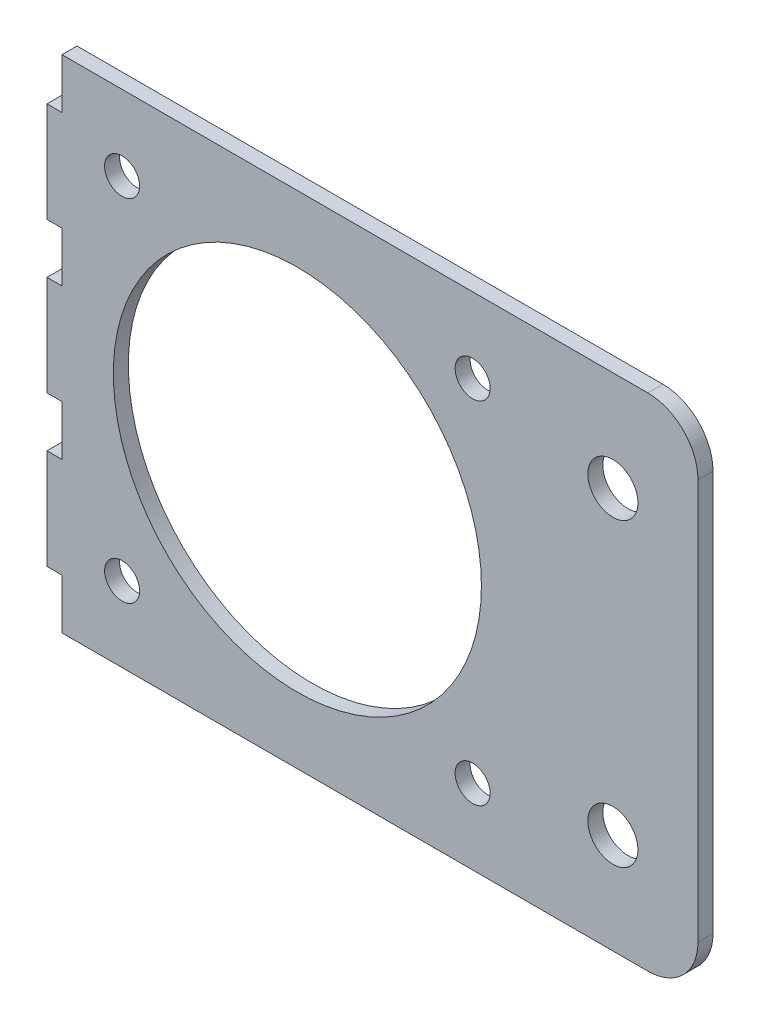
from build123d import *

# Parameters (mm, degrees)
ESQUISSE1_W             = 130
ESQUISSE1_H             = 100
BOSS_EXTRU_1_DEPTH      = 3
ENL_V_MAT_EXTRU_1_REACH = 166.04
ESQUISSE2_W             = 3
ESQUISSE2_H             = 10
ESQUISSE3_R             = 36.75
ESQUISSE3_R_2           = 3.5
ESQUISSE3_R_3           = 5
ENL_V_MAT_EXTRU_2_DEPTH = 3
CONG_1_R                = 10


with BuildPart() as part:
    # Esquisse1 → Boss.-Extru.1 (new body)
    with BuildSketch(Plane.XY):
        with Locations((65, 50)):
            Rectangle(ESQUISSE1_W, ESQUISSE1_H)
    extrude(amount=BOSS_EXTRU_1_DEPTH)

    # Esquisse2 → Enl_v. mat.-Extru.1 (cut, up to next)
    with BuildSketch(Plane.XY.offset(3), mode=Mode.PRIVATE) as enl_v_mat_extru_1_sk1:
        with Locations((1.5, 95)):
            Rectangle(ESQUISSE2_W, ESQUISSE2_H)
    enl_v_mat_extru_1_tool1 = extrude(enl_v_mat_extru_1_sk1.sketch, amount=-ENL_V_MAT_EXTRU_1_REACH, mode=Mode.PRIVATE) & part.part
    # Esquisse2 → Enl_v. mat.-Extru.1 (cut, up to next)
    with BuildSketch(Plane.XY.offset(3), mode=Mode.PRIVATE) as enl_v_mat_extru_1_sk2:
        with Locations((1.5, 65)):
            Rectangle(ESQUISSE2_W, ESQUISSE2_H)
    enl_v_mat_extru_1_tool2 = extrude(enl_v_mat_extru_1_sk2.sketch, amount=-ENL_V_MAT_EXTRU_1_REACH, mode=Mode.PRIVATE) & part.part
    # Esquisse2 → Enl_v. mat.-Extru.1 (cut, up to next)
    with BuildSketch(Plane.XY.offset(3), mode=Mode.PRIVATE) as enl_v_mat_extru_1_sk3:
        with Locations((1.5, 35)):
            Rectangle(ESQUISSE2_W, ESQUISSE2_H)
    enl_v_mat_extru_1_tool3 = extrude(enl_v_mat_extru_1_sk3.sketch, amount=-ENL_V_MAT_EXTRU_1_REACH, mode=Mode.PRIVATE) & part.part
    # Esquisse2 → Enl_v. mat.-Extru.1 (cut, up to next)
    with BuildSketch(Plane.XY.offset(3), mode=Mode.PRIVATE) as enl_v_mat_extru_1_sk4:
        with Locations((1.5, 5)):
            Rectangle(ESQUISSE2_W, ESQUISSE2_H)
    enl_v_mat_extru_1_tool4 = extrude(enl_v_mat_extru_1_sk4.sketch, amount=-ENL_V_MAT_EXTRU_1_REACH, mode=Mode.PRIVATE) & part.part
    add(enl_v_mat_extru_1_tool1.solids().sort_by_distance((1.5, 95, 3))[0], mode=Mode.SUBTRACT)
    add(enl_v_mat_extru_1_tool2.solids().sort_by_distance((1.5, 65, 3))[0], mode=Mode.SUBTRACT)
    add(enl_v_mat_extru_1_tool3.solids().sort_by_distance((1.5, 35, 3))[0], mode=Mode.SUBTRACT)
    add(enl_v_mat_extru_1_tool4.solids().sort_by_distance((1.5, 5, 3))[0], mode=Mode.SUBTRACT)

    # Esquisse3 → Enl_v. mat.-Extru.2 (cut)
    with BuildSketch(Plane.XY.offset(3)):
        with Locations((50, 50)):
            Circle(ESQUISSE3_R)
        with Locations((15, 85)):
            Circle(ESQUISSE3_R_2)
        with Locations((85, 85)):
            Circle(ESQUISSE3_R_2)
        with Locations((15, 15)):
            Circle(ESQUISSE3_R_2)
        with Locations((85, 15)):
            Circle(ESQUISSE3_R_2)
        with Locations((113, 80)):
            Circle(ESQUISSE3_R_3)
        with Locations((113, 20)):
            Circle(ESQUISSE3_R_3)
    extrude(amount=-ENL_V_MAT_EXTRU_2_DEPTH, mode=Mode.SUBTRACT)

    # Cong_1
    cong_1_edges = [part.edges().sort_by_distance(p)[0] for p in [
        (130, 100, 1.5),
        (130, 0, 1.5),
    ]]
    fillet(cong_1_edges, radius=CONG_1_R)


solid = part.part
